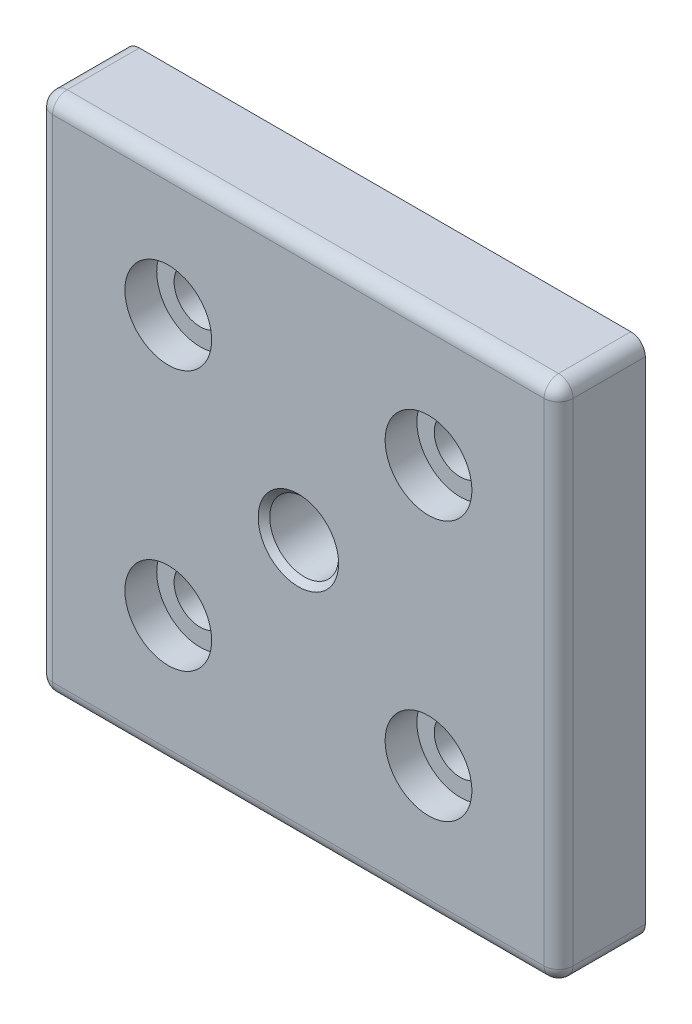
ISO-10303-21;
HEADER;
FILE_DESCRIPTION(('STEP AP214'),'2;1');
FILE_NAME('part.step','',(''),(''),'','','');
FILE_SCHEMA(('AUTOMOTIVE_DESIGN { 1 0 10303 214 1 1 1 1 }'));
ENDSEC;
DATA;
#1=APPLICATION_CONTEXT('core data for automotive mechanical design processes');
#2=APPLICATION_PROTOCOL_DEFINITION('international standard','automotive_design',2000,#1);
#3=PRODUCT_CONTEXT('',#1,'mechanical');
#4=PRODUCT('Part','Part','',(#3));
#5=PRODUCT_RELATED_PRODUCT_CATEGORY('part','',(#4));
#6=PRODUCT_DEFINITION_FORMATION('','',#4);
#7=PRODUCT_DEFINITION_CONTEXT('part definition',#1,'design');
#8=PRODUCT_DEFINITION('design','',#6,#7);
#9=PRODUCT_DEFINITION_SHAPE('','',#8);
#10=(LENGTH_UNIT() NAMED_UNIT(*) SI_UNIT(.MILLI.,.METRE.));
#11=(NAMED_UNIT(*) PLANE_ANGLE_UNIT() SI_UNIT($,.RADIAN.));
#12=(NAMED_UNIT(*) SI_UNIT($,.STERADIAN.) SOLID_ANGLE_UNIT());
#13=UNCERTAINTY_MEASURE_WITH_UNIT(LENGTH_MEASURE(1.E-05),#10,'distance_accuracy_value','');
#14=(GEOMETRIC_REPRESENTATION_CONTEXT(3) GLOBAL_UNCERTAINTY_ASSIGNED_CONTEXT((#13)) GLOBAL_UNIT_ASSIGNED_CONTEXT((#10,
#11,#12)) REPRESENTATION_CONTEXT('',''));
#15=CARTESIAN_POINT('',(0.,0.,0.));
#16=DIRECTION('',(0.,0.,1.));
#17=DIRECTION('',(1.,0.,0.));
#18=AXIS2_PLACEMENT_3D('',#15,#16,#17);
#19=CARTESIAN_POINT('',(0.,0.,15.));
#20=DIRECTION('',(0.,0.,1.));
#21=DIRECTION('',(1.,0.,0.));
#22=AXIS2_PLACEMENT_3D('',#19,#20,#21);
#23=PLANE('',#22);
#24=CARTESIAN_POINT('',(0.,0.,15.0000000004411));
#25=DIRECTION('',(0.,0.,1.));
#26=DIRECTION('',(1.,0.,0.));
#27=AXIS2_PLACEMENT_3D('',#24,#25,#26);
#28=CIRCLE('',#27,6.95312499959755);
#29=CARTESIAN_POINT('',(6.95312499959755,0.,15.0000000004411));
#30=VERTEX_POINT('',#29);
#31=EDGE_CURVE('E119',#30,#30,#28,.F.);
#32=ORIENTED_EDGE('',*,*,#31,.T.);
#33=EDGE_LOOP('',(#32));
#34=FACE_BOUND('',#33,.T.);
#35=CARTESIAN_POINT('',(22.5,-22.5,15.));
#36=DIRECTION('',(0.,0.,-1.));
#37=DIRECTION('',(-1.,0.,0.));
#38=AXIS2_PLACEMENT_3D('',#35,#36,#37);
#39=CIRCLE('',#38,7.5);
#40=CARTESIAN_POINT('',(15.,-22.5,15.));
#41=VERTEX_POINT('',#40);
#42=EDGE_CURVE('E123',#41,#41,#39,.T.);
#43=ORIENTED_EDGE('',*,*,#42,.T.);
#44=EDGE_LOOP('',(#43));
#45=FACE_BOUND('',#44,.T.);
#46=CARTESIAN_POINT('',(-22.5,-22.5,15.));
#47=DIRECTION('',(0.,0.,-1.));
#48=DIRECTION('',(-1.,0.,0.));
#49=AXIS2_PLACEMENT_3D('',#46,#47,#48);
#50=CIRCLE('',#49,7.5);
#51=CARTESIAN_POINT('',(-30.,-22.5,15.));
#52=VERTEX_POINT('',#51);
#53=EDGE_CURVE('E127',#52,#52,#50,.T.);
#54=ORIENTED_EDGE('',*,*,#53,.T.);
#55=EDGE_LOOP('',(#54));
#56=FACE_BOUND('',#55,.T.);
#57=CARTESIAN_POINT('',(-22.5,22.5,15.));
#58=DIRECTION('',(0.,0.,-1.));
#59=DIRECTION('',(-1.,0.,0.));
#60=AXIS2_PLACEMENT_3D('',#57,#58,#59);
#61=CIRCLE('',#60,7.5);
#62=CARTESIAN_POINT('',(-30.,22.5,15.));
#63=VERTEX_POINT('',#62);
#64=EDGE_CURVE('E19',#63,#63,#61,.T.);
#65=ORIENTED_EDGE('',*,*,#64,.T.);
#66=EDGE_LOOP('',(#65));
#67=FACE_BOUND('',#66,.T.);
#68=CARTESIAN_POINT('',(22.5,22.5,15.));
#69=DIRECTION('',(0.,0.,-1.));
#70=DIRECTION('',(-1.,0.,0.));
#71=AXIS2_PLACEMENT_3D('',#68,#69,#70);
#72=CIRCLE('',#71,7.5);
#73=CARTESIAN_POINT('',(15.,22.5,15.));
#74=VERTEX_POINT('',#73);
#75=EDGE_CURVE('E129',#74,#74,#72,.T.);
#76=ORIENTED_EDGE('',*,*,#75,.T.);
#77=EDGE_LOOP('',(#76));
#78=FACE_BOUND('',#77,.T.);
#79=DIRECTION('',(-1.,0.,0.));
#80=VECTOR('',#79,1.);
#81=CARTESIAN_POINT('',(22.5,-42.5,15.));
#82=LINE('',#81,#80);
#83=CARTESIAN_POINT('',(42.5,-42.5,15.));
#84=VERTEX_POINT('',#83);
#85=CARTESIAN_POINT('',(-42.5,-42.5,15.));
#86=VERTEX_POINT('',#85);
#87=EDGE_CURVE('E362',#84,#86,#82,.T.);
#88=ORIENTED_EDGE('',*,*,#87,.F.);
#89=DIRECTION('',(0.,-1.,0.));
#90=VECTOR('',#89,1.);
#91=CARTESIAN_POINT('',(42.5,22.5,15.));
#92=LINE('',#91,#90);
#93=CARTESIAN_POINT('',(42.5,42.5,15.));
#94=VERTEX_POINT('',#93);
#95=EDGE_CURVE('E229',#94,#84,#92,.T.);
#96=ORIENTED_EDGE('',*,*,#95,.F.);
#97=DIRECTION('',(1.,0.,0.));
#98=VECTOR('',#97,1.);
#99=CARTESIAN_POINT('',(-22.5,42.5,15.));
#100=LINE('',#99,#98);
#101=CARTESIAN_POINT('',(-42.5,42.5,15.));
#102=VERTEX_POINT('',#101);
#103=EDGE_CURVE('E126',#102,#94,#100,.T.);
#104=ORIENTED_EDGE('',*,*,#103,.F.);
#105=DIRECTION('',(0.,1.,0.));
#106=VECTOR('',#105,1.);
#107=CARTESIAN_POINT('',(-42.5,-22.5,15.));
#108=LINE('',#107,#106);
#109=EDGE_CURVE('E272',#86,#102,#108,.T.);
#110=ORIENTED_EDGE('',*,*,#109,.F.);
#111=EDGE_LOOP('',(#88,#96,#104,#110));
#112=FACE_BOUND('',#111,.T.);
#113=ADVANCED_FACE('F15',(#34,#45,#56,#67,#78,#112),#23,.T.);
#114=CARTESIAN_POINT('',(-22.5,22.5,15.));
#115=DIRECTION('',(0.,0.,-1.));
#116=DIRECTION('',(-1.,0.,0.));
#117=AXIS2_PLACEMENT_3D('',#114,#115,#116);
#118=CYLINDRICAL_SURFACE('',#117,7.5);
#119=CARTESIAN_POINT('',(-22.5,22.5,9.5));
#120=DIRECTION('',(0.,0.,-1.));
#121=DIRECTION('',(-1.,0.,0.));
#122=AXIS2_PLACEMENT_3D('',#119,#120,#121);
#123=CIRCLE('',#122,7.5);
#124=CARTESIAN_POINT('',(-30.,22.5,9.5));
#125=VERTEX_POINT('',#124);
#126=EDGE_CURVE('E116',#125,#125,#123,.T.);
#127=ORIENTED_EDGE('',*,*,#126,.T.);
#128=EDGE_LOOP('',(#127));
#129=FACE_BOUND('',#128,.T.);
#130=ORIENTED_EDGE('',*,*,#64,.F.);
#131=EDGE_LOOP('',(#130));
#132=FACE_BOUND('',#131,.T.);
#133=ADVANCED_FACE('F137',(#129,#132),#118,.F.);
#134=CARTESIAN_POINT('',(22.5,22.5,15.));
#135=DIRECTION('',(0.,0.,-1.));
#136=DIRECTION('',(-1.,0.,0.));
#137=AXIS2_PLACEMENT_3D('',#134,#135,#136);
#138=CYLINDRICAL_SURFACE('',#137,7.5);
#139=CARTESIAN_POINT('',(22.5,22.5,9.5));
#140=DIRECTION('',(0.,0.,-1.));
#141=DIRECTION('',(-1.,0.,0.));
#142=AXIS2_PLACEMENT_3D('',#139,#140,#141);
#143=CIRCLE('',#142,7.5);
#144=CARTESIAN_POINT('',(15.,22.5,9.5));
#145=VERTEX_POINT('',#144);
#146=EDGE_CURVE('E113',#145,#145,#143,.T.);
#147=ORIENTED_EDGE('',*,*,#146,.T.);
#148=EDGE_LOOP('',(#147));
#149=FACE_BOUND('',#148,.T.);
#150=ORIENTED_EDGE('',*,*,#75,.F.);
#151=EDGE_LOOP('',(#150));
#152=FACE_BOUND('',#151,.T.);
#153=ADVANCED_FACE('F139',(#149,#152),#138,.F.);
#154=CARTESIAN_POINT('',(-22.5,-22.5,15.));
#155=DIRECTION('',(0.,0.,-1.));
#156=DIRECTION('',(-1.,0.,0.));
#157=AXIS2_PLACEMENT_3D('',#154,#155,#156);
#158=CYLINDRICAL_SURFACE('',#157,7.5);
#159=CARTESIAN_POINT('',(-22.5,-22.5,9.5));
#160=DIRECTION('',(0.,0.,-1.));
#161=DIRECTION('',(-1.,0.,0.));
#162=AXIS2_PLACEMENT_3D('',#159,#160,#161);
#163=CIRCLE('',#162,7.5);
#164=CARTESIAN_POINT('',(-30.,-22.5,9.5));
#165=VERTEX_POINT('',#164);
#166=EDGE_CURVE('E110',#165,#165,#163,.T.);
#167=ORIENTED_EDGE('',*,*,#166,.T.);
#168=EDGE_LOOP('',(#167));
#169=FACE_BOUND('',#168,.T.);
#170=ORIENTED_EDGE('',*,*,#53,.F.);
#171=EDGE_LOOP('',(#170));
#172=FACE_BOUND('',#171,.T.);
#173=ADVANCED_FACE('F147',(#169,#172),#158,.F.);
#174=CARTESIAN_POINT('',(22.5,-22.5,15.));
#175=DIRECTION('',(0.,0.,-1.));
#176=DIRECTION('',(-1.,0.,0.));
#177=AXIS2_PLACEMENT_3D('',#174,#175,#176);
#178=CYLINDRICAL_SURFACE('',#177,7.5);
#179=CARTESIAN_POINT('',(22.5,-22.5,9.5));
#180=DIRECTION('',(0.,0.,-1.));
#181=DIRECTION('',(-1.,0.,0.));
#182=AXIS2_PLACEMENT_3D('',#179,#180,#181);
#183=CIRCLE('',#182,7.5);
#184=CARTESIAN_POINT('',(15.,-22.5,9.5));
#185=VERTEX_POINT('',#184);
#186=EDGE_CURVE('E106',#185,#185,#183,.T.);
#187=ORIENTED_EDGE('',*,*,#186,.T.);
#188=EDGE_LOOP('',(#187));
#189=FACE_BOUND('',#188,.T.);
#190=ORIENTED_EDGE('',*,*,#42,.F.);
#191=EDGE_LOOP('',(#190));
#192=FACE_BOUND('',#191,.T.);
#193=ADVANCED_FACE('F287',(#189,#192),#178,.F.);
#194=CARTESIAN_POINT('',(-22.5,42.5,12.5));
#195=DIRECTION('',(1.,0.,0.));
#196=DIRECTION('',(0.,1.,0.));
#197=AXIS2_PLACEMENT_3D('',#194,#195,#196);
#198=CYLINDRICAL_SURFACE('',#197,2.5);
#199=CARTESIAN_POINT('',(-42.5,42.5,12.5));
#200=DIRECTION('',(1.,0.,0.));
#201=DIRECTION('',(0.,1.,0.));
#202=AXIS2_PLACEMENT_3D('',#199,#200,#201);
#203=CIRCLE('',#202,2.5);
#204=CARTESIAN_POINT('',(-42.5,45.,12.5));
#205=VERTEX_POINT('',#204);
#206=EDGE_CURVE('E276',#102,#205,#203,.F.);
#207=ORIENTED_EDGE('',*,*,#206,.F.);
#208=ORIENTED_EDGE('',*,*,#103,.T.);
#209=CARTESIAN_POINT('',(42.5,42.5,12.5));
#210=DIRECTION('',(1.,0.,0.));
#211=DIRECTION('',(0.,1.,0.));
#212=AXIS2_PLACEMENT_3D('',#209,#210,#211);
#213=CIRCLE('',#212,2.5);
#214=CARTESIAN_POINT('',(42.5,45.,12.5));
#215=VERTEX_POINT('',#214);
#216=EDGE_CURVE('E226',#215,#94,#213,.T.);
#217=ORIENTED_EDGE('',*,*,#216,.F.);
#218=DIRECTION('',(1.,0.,0.));
#219=VECTOR('',#218,1.);
#220=CARTESIAN_POINT('',(-45.,45.,12.5));
#221=LINE('',#220,#219);
#222=EDGE_CURVE('E109',#205,#215,#221,.T.);
#223=ORIENTED_EDGE('',*,*,#222,.F.);
#224=EDGE_LOOP('',(#207,#208,#217,#223));
#225=FACE_BOUND('',#224,.T.);
#226=ADVANCED_FACE('F284',(#225),#198,.T.);
#227=CARTESIAN_POINT('',(-42.5,42.5,12.5));
#228=DIRECTION('',(1.,0.,0.));
#229=DIRECTION('',(0.,1.,0.));
#230=AXIS2_PLACEMENT_3D('',#227,#228,#229);
#231=SPHERICAL_SURFACE('',#230,2.5);
#232=ORIENTED_EDGE('',*,*,#206,.T.);
#233=CARTESIAN_POINT('',(-42.5,42.5,12.5));
#234=DIRECTION('',(0.,0.,1.));
#235=DIRECTION('',(1.,0.,0.));
#236=AXIS2_PLACEMENT_3D('',#233,#234,#235);
#237=CIRCLE('',#236,2.5);
#238=CARTESIAN_POINT('',(-45.,42.5,12.5));
#239=VERTEX_POINT('',#238);
#240=EDGE_CURVE('E232',#239,#205,#237,.F.);
#241=ORIENTED_EDGE('',*,*,#240,.F.);
#242=CARTESIAN_POINT('',(-42.5,42.5,12.5));
#243=DIRECTION('',(0.,1.,0.));
#244=DIRECTION('',(-1.,0.,0.));
#245=AXIS2_PLACEMENT_3D('',#242,#243,#244);
#246=CIRCLE('',#245,2.5);
#247=EDGE_CURVE('E273',#102,#239,#246,.F.);
#248=ORIENTED_EDGE('',*,*,#247,.F.);
#249=EDGE_LOOP('',(#232,#241,#248));
#250=FACE_BOUND('',#249,.T.);
#251=ADVANCED_FACE('F281',(#250),#231,.T.);
#252=CARTESIAN_POINT('',(-42.5,-22.5,12.5));
#253=DIRECTION('',(0.,1.,0.));
#254=DIRECTION('',(-1.,0.,0.));
#255=AXIS2_PLACEMENT_3D('',#252,#253,#254);
#256=CYLINDRICAL_SURFACE('',#255,2.5);
#257=CARTESIAN_POINT('',(-42.5,-42.5,12.5));
#258=DIRECTION('',(0.,-1.,0.));
#259=DIRECTION('',(1.,0.,0.));
#260=AXIS2_PLACEMENT_3D('',#257,#258,#259);
#261=CIRCLE('',#260,2.5);
#262=CARTESIAN_POINT('',(-45.,-42.5,12.5));
#263=VERTEX_POINT('',#262);
#264=EDGE_CURVE('E268',#86,#263,#261,.T.);
#265=ORIENTED_EDGE('',*,*,#264,.F.);
#266=ORIENTED_EDGE('',*,*,#109,.T.);
#267=ORIENTED_EDGE('',*,*,#247,.T.);
#268=DIRECTION('',(0.,1.,0.));
#269=VECTOR('',#268,1.);
#270=CARTESIAN_POINT('',(-45.,-45.,12.5));
#271=LINE('',#270,#269);
#272=EDGE_CURVE('E74',#263,#239,#271,.T.);
#273=ORIENTED_EDGE('',*,*,#272,.F.);
#274=EDGE_LOOP('',(#265,#266,#267,#273));
#275=FACE_BOUND('',#274,.T.);
#276=ADVANCED_FACE('F261',(#275),#256,.T.);
#277=CARTESIAN_POINT('',(-42.5,-42.5,12.5));
#278=DIRECTION('',(1.,0.,0.));
#279=DIRECTION('',(0.,1.,0.));
#280=AXIS2_PLACEMENT_3D('',#277,#278,#279);
#281=SPHERICAL_SURFACE('',#280,2.5);
#282=ORIENTED_EDGE('',*,*,#264,.T.);
#283=CARTESIAN_POINT('',(-42.5,-42.5,12.5));
#284=DIRECTION('',(0.,0.,1.));
#285=DIRECTION('',(1.,0.,0.));
#286=AXIS2_PLACEMENT_3D('',#283,#284,#285);
#287=CIRCLE('',#286,2.5);
#288=CARTESIAN_POINT('',(-42.5,-45.,12.5));
#289=VERTEX_POINT('',#288);
#290=EDGE_CURVE('E357',#289,#263,#287,.F.);
#291=ORIENTED_EDGE('',*,*,#290,.F.);
#292=CARTESIAN_POINT('',(-42.5,-42.5,12.5));
#293=DIRECTION('',(-1.,0.,0.));
#294=DIRECTION('',(0.,-1.,0.));
#295=AXIS2_PLACEMENT_3D('',#292,#293,#294);
#296=CIRCLE('',#295,2.5);
#297=EDGE_CURVE('E271',#86,#289,#296,.F.);
#298=ORIENTED_EDGE('',*,*,#297,.F.);
#299=EDGE_LOOP('',(#282,#291,#298));
#300=FACE_BOUND('',#299,.T.);
#301=ADVANCED_FACE('F256',(#300),#281,.T.);
#302=CARTESIAN_POINT('',(22.5,-42.5,12.5));
#303=DIRECTION('',(-1.,0.,0.));
#304=DIRECTION('',(0.,-1.,0.));
#305=AXIS2_PLACEMENT_3D('',#302,#303,#304);
#306=CYLINDRICAL_SURFACE('',#305,2.5);
#307=CARTESIAN_POINT('',(42.5,-42.5,12.5));
#308=DIRECTION('',(1.,0.,0.));
#309=DIRECTION('',(0.,1.,0.));
#310=AXIS2_PLACEMENT_3D('',#307,#308,#309);
#311=CIRCLE('',#310,2.5);
#312=CARTESIAN_POINT('',(42.5,-45.,12.5));
#313=VERTEX_POINT('',#312);
#314=EDGE_CURVE('E241',#84,#313,#311,.T.);
#315=ORIENTED_EDGE('',*,*,#314,.F.);
#316=ORIENTED_EDGE('',*,*,#87,.T.);
#317=ORIENTED_EDGE('',*,*,#297,.T.);
#318=DIRECTION('',(1.,0.,0.));
#319=VECTOR('',#318,1.);
#320=CARTESIAN_POINT('',(45.,-45.,12.5));
#321=LINE('',#320,#319);
#322=EDGE_CURVE('E242',#313,#289,#321,.F.);
#323=ORIENTED_EDGE('',*,*,#322,.F.);
#324=EDGE_LOOP('',(#315,#316,#317,#323));
#325=FACE_BOUND('',#324,.T.);
#326=ADVANCED_FACE('F252',(#325),#306,.T.);
#327=CARTESIAN_POINT('',(42.5,-42.5,12.5));
#328=DIRECTION('',(1.,0.,0.));
#329=DIRECTION('',(0.,1.,0.));
#330=AXIS2_PLACEMENT_3D('',#327,#328,#329);
#331=SPHERICAL_SURFACE('',#330,2.5);
#332=CARTESIAN_POINT('',(42.5,-42.5,12.5));
#333=DIRECTION('',(0.,-1.,0.));
#334=DIRECTION('',(0.,0.,-1.));
#335=AXIS2_PLACEMENT_3D('',#332,#333,#334);
#336=CIRCLE('',#335,2.5);
#337=CARTESIAN_POINT('',(45.,-42.5,12.5));
#338=VERTEX_POINT('',#337);
#339=EDGE_CURVE('E238',#84,#338,#336,.F.);
#340=ORIENTED_EDGE('',*,*,#339,.F.);
#341=ORIENTED_EDGE('',*,*,#314,.T.);
#342=CARTESIAN_POINT('',(42.5,-42.5,12.5));
#343=DIRECTION('',(0.,0.,1.));
#344=DIRECTION('',(1.,0.,0.));
#345=AXIS2_PLACEMENT_3D('',#342,#343,#344);
#346=CIRCLE('',#345,2.5);
#347=EDGE_CURVE('E233',#338,#313,#346,.F.);
#348=ORIENTED_EDGE('',*,*,#347,.F.);
#349=EDGE_LOOP('',(#340,#341,#348));
#350=FACE_BOUND('',#349,.T.);
#351=ADVANCED_FACE('F249',(#350),#331,.T.);
#352=CARTESIAN_POINT('',(42.5,22.5,12.5));
#353=DIRECTION('',(0.,-1.,0.));
#354=DIRECTION('',(0.,0.,-1.));
#355=AXIS2_PLACEMENT_3D('',#352,#353,#354);
#356=CYLINDRICAL_SURFACE('',#355,2.5);
#357=CARTESIAN_POINT('',(42.5,42.5,12.5));
#358=DIRECTION('',(0.,-1.,0.));
#359=DIRECTION('',(1.,0.,0.));
#360=AXIS2_PLACEMENT_3D('',#357,#358,#359);
#361=CIRCLE('',#360,2.5);
#362=CARTESIAN_POINT('',(45.,42.5,12.5));
#363=VERTEX_POINT('',#362);
#364=EDGE_CURVE('E122',#94,#363,#361,.F.);
#365=ORIENTED_EDGE('',*,*,#364,.F.);
#366=ORIENTED_EDGE('',*,*,#95,.T.);
#367=ORIENTED_EDGE('',*,*,#339,.T.);
#368=DIRECTION('',(0.,1.,0.));
#369=VECTOR('',#368,1.);
#370=CARTESIAN_POINT('',(45.,45.,12.5));
#371=LINE('',#370,#369);
#372=EDGE_CURVE('E341',#363,#338,#371,.F.);
#373=ORIENTED_EDGE('',*,*,#372,.F.);
#374=EDGE_LOOP('',(#365,#366,#367,#373));
#375=FACE_BOUND('',#374,.T.);
#376=ADVANCED_FACE('F216',(#375),#356,.T.);
#377=CARTESIAN_POINT('',(42.5,42.5,12.5));
#378=DIRECTION('',(1.,0.,0.));
#379=DIRECTION('',(0.,1.,0.));
#380=AXIS2_PLACEMENT_3D('',#377,#378,#379);
#381=SPHERICAL_SURFACE('',#380,2.5);
#382=ORIENTED_EDGE('',*,*,#216,.T.);
#383=ORIENTED_EDGE('',*,*,#364,.T.);
#384=CARTESIAN_POINT('',(42.5,42.5,12.5));
#385=DIRECTION('',(0.,0.,1.));
#386=DIRECTION('',(1.,0.,0.));
#387=AXIS2_PLACEMENT_3D('',#384,#385,#386);
#388=CIRCLE('',#387,2.5);
#389=EDGE_CURVE('E222',#215,#363,#388,.F.);
#390=ORIENTED_EDGE('',*,*,#389,.F.);
#391=EDGE_LOOP('',(#382,#383,#390));
#392=FACE_BOUND('',#391,.T.);
#393=ADVANCED_FACE('F211',(#392),#381,.T.);
#394=CARTESIAN_POINT('',(0.,0.,15.0000000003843));
#395=DIRECTION('',(0.,0.,1.));
#396=DIRECTION('',(1.,0.,0.));
#397=AXIS2_PLACEMENT_3D('',#394,#395,#396);
#398=CONICAL_SURFACE('',#397,6.95312499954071,0.785398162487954);
#399=ORIENTED_EDGE('',*,*,#31,.F.);
#400=EDGE_LOOP('',(#399));
#401=FACE_BOUND('',#400,.T.);
#402=CARTESIAN_POINT('',(0.,0.,14.));
#403=DIRECTION('',(0.,0.,1.));
#404=DIRECTION('',(1.,0.,0.));
#405=AXIS2_PLACEMENT_3D('',#402,#403,#404);
#406=CIRCLE('',#405,5.953125);
#407=CARTESIAN_POINT('',(5.953125,0.,14.));
#408=VERTEX_POINT('',#407);
#409=EDGE_CURVE('E105',#408,#408,#406,.F.);
#410=ORIENTED_EDGE('',*,*,#409,.T.);
#411=EDGE_LOOP('',(#410));
#412=FACE_BOUND('',#411,.T.);
#413=ADVANCED_FACE('F207',(#401,#412),#398,.F.);
#414=CARTESIAN_POINT('',(-30.15,30.15,9.5));
#415=DIRECTION('',(0.,0.,-1.));
#416=DIRECTION('',(1.,0.,0.));
#417=AXIS2_PLACEMENT_3D('',#414,#415,#416);
#418=PLANE('',#417);
#419=CARTESIAN_POINT('',(-22.5,22.5,9.5));
#420=DIRECTION('',(0.,0.,1.));
#421=DIRECTION('',(1.,0.,0.));
#422=AXIS2_PLACEMENT_3D('',#419,#420,#421);
#423=CIRCLE('',#422,4.5);
#424=CARTESIAN_POINT('',(-18.,22.5,9.5));
#425=VERTEX_POINT('',#424);
#426=EDGE_CURVE('E102',#425,#425,#423,.F.);
#427=ORIENTED_EDGE('',*,*,#426,.T.);
#428=EDGE_LOOP('',(#427));
#429=FACE_BOUND('',#428,.T.);
#430=ORIENTED_EDGE('',*,*,#126,.F.);
#431=EDGE_LOOP('',(#430));
#432=FACE_BOUND('',#431,.T.);
#433=ADVANCED_FACE('F210',(#429,#432),#418,.F.);
#434=CARTESIAN_POINT('',(14.85,30.15,9.5));
#435=DIRECTION('',(0.,0.,-1.));
#436=DIRECTION('',(1.,0.,0.));
#437=AXIS2_PLACEMENT_3D('',#434,#435,#436);
#438=PLANE('',#437);
#439=CARTESIAN_POINT('',(22.5,22.5,9.5));
#440=DIRECTION('',(0.,0.,1.));
#441=DIRECTION('',(1.,0.,0.));
#442=AXIS2_PLACEMENT_3D('',#439,#440,#441);
#443=CIRCLE('',#442,4.5);
#444=CARTESIAN_POINT('',(27.,22.5,9.5));
#445=VERTEX_POINT('',#444);
#446=EDGE_CURVE('E99',#445,#445,#443,.F.);
#447=ORIENTED_EDGE('',*,*,#446,.T.);
#448=EDGE_LOOP('',(#447));
#449=FACE_BOUND('',#448,.T.);
#450=ORIENTED_EDGE('',*,*,#146,.F.);
#451=EDGE_LOOP('',(#450));
#452=FACE_BOUND('',#451,.T.);
#453=ADVANCED_FACE('F400',(#449,#452),#438,.F.);
#454=CARTESIAN_POINT('',(-30.15,-14.85,9.5));
#455=DIRECTION('',(0.,0.,-1.));
#456=DIRECTION('',(1.,0.,0.));
#457=AXIS2_PLACEMENT_3D('',#454,#455,#456);
#458=PLANE('',#457);
#459=CARTESIAN_POINT('',(-22.5,-22.5,9.5));
#460=DIRECTION('',(0.,0.,1.));
#461=DIRECTION('',(1.,0.,0.));
#462=AXIS2_PLACEMENT_3D('',#459,#460,#461);
#463=CIRCLE('',#462,4.5);
#464=CARTESIAN_POINT('',(-18.,-22.5,9.5));
#465=VERTEX_POINT('',#464);
#466=EDGE_CURVE('E96',#465,#465,#463,.F.);
#467=ORIENTED_EDGE('',*,*,#466,.T.);
#468=EDGE_LOOP('',(#467));
#469=FACE_BOUND('',#468,.T.);
#470=ORIENTED_EDGE('',*,*,#166,.F.);
#471=EDGE_LOOP('',(#470));
#472=FACE_BOUND('',#471,.T.);
#473=ADVANCED_FACE('F406',(#469,#472),#458,.F.);
#474=CARTESIAN_POINT('',(14.85,-14.85,9.5));
#475=DIRECTION('',(0.,0.,-1.));
#476=DIRECTION('',(1.,0.,0.));
#477=AXIS2_PLACEMENT_3D('',#474,#475,#476);
#478=PLANE('',#477);
#479=CARTESIAN_POINT('',(22.5,-22.5,9.5));
#480=DIRECTION('',(0.,0.,1.));
#481=DIRECTION('',(1.,0.,0.));
#482=AXIS2_PLACEMENT_3D('',#479,#480,#481);
#483=CIRCLE('',#482,4.5);
#484=CARTESIAN_POINT('',(27.,-22.5,9.5));
#485=VERTEX_POINT('',#484);
#486=EDGE_CURVE('E89',#485,#485,#483,.F.);
#487=ORIENTED_EDGE('',*,*,#486,.T.);
#488=EDGE_LOOP('',(#487));
#489=FACE_BOUND('',#488,.T.);
#490=ORIENTED_EDGE('',*,*,#186,.F.);
#491=EDGE_LOOP('',(#490));
#492=FACE_BOUND('',#491,.T.);
#493=ADVANCED_FACE('F17',(#489,#492),#478,.F.);
#494=CARTESIAN_POINT('',(-45.,45.,0.));
#495=DIRECTION('',(0.,1.,0.));
#496=DIRECTION('',(0.,0.,1.));
#497=AXIS2_PLACEMENT_3D('',#494,#495,#496);
#498=PLANE('',#497);
#499=DIRECTION('',(0.,0.,1.));
#500=VECTOR('',#499,1.);
#501=CARTESIAN_POINT('',(-42.5,45.,0.));
#502=LINE('',#501,#500);
#503=CARTESIAN_POINT('',(-42.5,45.,0.));
#504=VERTEX_POINT('',#503);
#505=EDGE_CURVE('E60',#205,#504,#502,.F.);
#506=ORIENTED_EDGE('',*,*,#505,.F.);
#507=ORIENTED_EDGE('',*,*,#222,.T.);
#508=DIRECTION('',(0.,0.,1.));
#509=VECTOR('',#508,1.);
#510=CARTESIAN_POINT('',(42.5,45.,0.));
#511=LINE('',#510,#509);
#512=CARTESIAN_POINT('',(42.5,45.,0.));
#513=VERTEX_POINT('',#512);
#514=EDGE_CURVE('E339',#513,#215,#511,.T.);
#515=ORIENTED_EDGE('',*,*,#514,.F.);
#516=DIRECTION('',(1.,0.,0.));
#517=VECTOR('',#516,1.);
#518=CARTESIAN_POINT('',(0.,45.,0.));
#519=LINE('',#518,#517);
#520=EDGE_CURVE('E87',#513,#504,#519,.F.);
#521=ORIENTED_EDGE('',*,*,#520,.T.);
#522=EDGE_LOOP('',(#506,#507,#515,#521));
#523=FACE_BOUND('',#522,.T.);
#524=ADVANCED_FACE('F203',(#523),#498,.T.);
#525=CARTESIAN_POINT('',(-42.5,42.5,0.));
#526=DIRECTION('',(0.,0.,1.));
#527=DIRECTION('',(1.,0.,0.));
#528=AXIS2_PLACEMENT_3D('',#525,#526,#527);
#529=CYLINDRICAL_SURFACE('',#528,2.5);
#530=ORIENTED_EDGE('',*,*,#240,.T.);
#531=ORIENTED_EDGE('',*,*,#505,.T.);
#532=CARTESIAN_POINT('',(-42.5,42.5,0.));
#533=DIRECTION('',(0.,0.,1.));
#534=DIRECTION('',(1.,0.,0.));
#535=AXIS2_PLACEMENT_3D('',#532,#533,#534);
#536=CIRCLE('',#535,2.5);
#537=CARTESIAN_POINT('',(-45.,42.5,0.));
#538=VERTEX_POINT('',#537);
#539=EDGE_CURVE('E80',#504,#538,#536,.T.);
#540=ORIENTED_EDGE('',*,*,#539,.T.);
#541=DIRECTION('',(0.,0.,1.));
#542=VECTOR('',#541,1.);
#543=CARTESIAN_POINT('',(-45.,42.5,0.));
#544=LINE('',#543,#542);
#545=EDGE_CURVE('E67',#239,#538,#544,.F.);
#546=ORIENTED_EDGE('',*,*,#545,.F.);
#547=EDGE_LOOP('',(#530,#531,#540,#546));
#548=FACE_BOUND('',#547,.T.);
#549=ADVANCED_FACE('F86',(#548),#529,.T.);
#550=CARTESIAN_POINT('',(-45.,-45.,0.));
#551=DIRECTION('',(-1.,0.,0.));
#552=DIRECTION('',(0.,0.,1.));
#553=AXIS2_PLACEMENT_3D('',#550,#551,#552);
#554=PLANE('',#553);
#555=DIRECTION('',(0.,0.,1.));
#556=VECTOR('',#555,1.);
#557=CARTESIAN_POINT('',(-45.,-42.5,0.));
#558=LINE('',#557,#556);
#559=CARTESIAN_POINT('',(-45.,-42.5,0.));
#560=VERTEX_POINT('',#559);
#561=EDGE_CURVE('E245',#263,#560,#558,.F.);
#562=ORIENTED_EDGE('',*,*,#561,.F.);
#563=ORIENTED_EDGE('',*,*,#272,.T.);
#564=ORIENTED_EDGE('',*,*,#545,.T.);
#565=DIRECTION('',(0.,1.,0.));
#566=VECTOR('',#565,1.);
#567=CARTESIAN_POINT('',(-45.,0.,0.));
#568=LINE('',#567,#566);
#569=EDGE_CURVE('E71',#538,#560,#568,.F.);
#570=ORIENTED_EDGE('',*,*,#569,.T.);
#571=EDGE_LOOP('',(#562,#563,#564,#570));
#572=FACE_BOUND('',#571,.T.);
#573=ADVANCED_FACE('F70',(#572),#554,.T.);
#574=CARTESIAN_POINT('',(-42.5,-42.5,0.));
#575=DIRECTION('',(0.,0.,1.));
#576=DIRECTION('',(1.,0.,0.));
#577=AXIS2_PLACEMENT_3D('',#574,#575,#576);
#578=CYLINDRICAL_SURFACE('',#577,2.5);
#579=ORIENTED_EDGE('',*,*,#290,.T.);
#580=ORIENTED_EDGE('',*,*,#561,.T.);
#581=CARTESIAN_POINT('',(-42.5,-42.5,0.));
#582=DIRECTION('',(0.,0.,1.));
#583=DIRECTION('',(1.,0.,0.));
#584=AXIS2_PLACEMENT_3D('',#581,#582,#583);
#585=CIRCLE('',#584,2.5);
#586=CARTESIAN_POINT('',(-42.5,-45.,0.));
#587=VERTEX_POINT('',#586);
#588=EDGE_CURVE('E84',#560,#587,#585,.T.);
#589=ORIENTED_EDGE('',*,*,#588,.T.);
#590=DIRECTION('',(0.,0.,-1.));
#591=VECTOR('',#590,1.);
#592=CARTESIAN_POINT('',(-42.5,-45.,0.));
#593=LINE('',#592,#591);
#594=EDGE_CURVE('E237',#289,#587,#593,.T.);
#595=ORIENTED_EDGE('',*,*,#594,.F.);
#596=EDGE_LOOP('',(#579,#580,#589,#595));
#597=FACE_BOUND('',#596,.T.);
#598=ADVANCED_FACE('F194',(#597),#578,.T.);
#599=CARTESIAN_POINT('',(45.,-45.,0.));
#600=DIRECTION('',(0.,-1.,0.));
#601=DIRECTION('',(0.,0.,-1.));
#602=AXIS2_PLACEMENT_3D('',#599,#600,#601);
#603=PLANE('',#602);
#604=ORIENTED_EDGE('',*,*,#594,.T.);
#605=DIRECTION('',(1.,0.,0.));
#606=VECTOR('',#605,1.);
#607=CARTESIAN_POINT('',(0.,-45.,0.));
#608=LINE('',#607,#606);
#609=CARTESIAN_POINT('',(42.5,-45.,0.));
#610=VERTEX_POINT('',#609);
#611=EDGE_CURVE('E383',#587,#610,#608,.T.);
#612=ORIENTED_EDGE('',*,*,#611,.T.);
#613=DIRECTION('',(0.,0.,1.));
#614=VECTOR('',#613,1.);
#615=CARTESIAN_POINT('',(42.5,-45.,0.));
#616=LINE('',#615,#614);
#617=EDGE_CURVE('E236',#313,#610,#616,.F.);
#618=ORIENTED_EDGE('',*,*,#617,.F.);
#619=ORIENTED_EDGE('',*,*,#322,.T.);
#620=EDGE_LOOP('',(#604,#612,#618,#619));
#621=FACE_BOUND('',#620,.T.);
#622=ADVANCED_FACE('F190',(#621),#603,.T.);
#623=CARTESIAN_POINT('',(42.5,-42.5,0.));
#624=DIRECTION('',(0.,0.,1.));
#625=DIRECTION('',(1.,0.,0.));
#626=AXIS2_PLACEMENT_3D('',#623,#624,#625);
#627=CYLINDRICAL_SURFACE('',#626,2.5);
#628=ORIENTED_EDGE('',*,*,#347,.T.);
#629=ORIENTED_EDGE('',*,*,#617,.T.);
#630=CARTESIAN_POINT('',(42.5,-42.5,0.));
#631=DIRECTION('',(0.,0.,1.));
#632=DIRECTION('',(1.,0.,0.));
#633=AXIS2_PLACEMENT_3D('',#630,#631,#632);
#634=CIRCLE('',#633,2.5);
#635=CARTESIAN_POINT('',(45.,-42.5,0.));
#636=VERTEX_POINT('',#635);
#637=EDGE_CURVE('E381',#610,#636,#634,.T.);
#638=ORIENTED_EDGE('',*,*,#637,.T.);
#639=DIRECTION('',(0.,0.,-1.));
#640=VECTOR('',#639,1.);
#641=CARTESIAN_POINT('',(45.,-42.5,0.));
#642=LINE('',#641,#640);
#643=EDGE_CURVE('E344',#338,#636,#642,.T.);
#644=ORIENTED_EDGE('',*,*,#643,.F.);
#645=EDGE_LOOP('',(#628,#629,#638,#644));
#646=FACE_BOUND('',#645,.T.);
#647=ADVANCED_FACE('F186',(#646),#627,.T.);
#648=CARTESIAN_POINT('',(45.,45.,0.));
#649=DIRECTION('',(1.,0.,0.));
#650=DIRECTION('',(0.,0.,-1.));
#651=AXIS2_PLACEMENT_3D('',#648,#649,#650);
#652=PLANE('',#651);
#653=ORIENTED_EDGE('',*,*,#643,.T.);
#654=DIRECTION('',(0.,1.,0.));
#655=VECTOR('',#654,1.);
#656=CARTESIAN_POINT('',(45.,0.,0.));
#657=LINE('',#656,#655);
#658=CARTESIAN_POINT('',(45.,42.5,0.));
#659=VERTEX_POINT('',#658);
#660=EDGE_CURVE('E346',#636,#659,#657,.T.);
#661=ORIENTED_EDGE('',*,*,#660,.T.);
#662=DIRECTION('',(0.,0.,1.));
#663=VECTOR('',#662,1.);
#664=CARTESIAN_POINT('',(45.,42.5,0.));
#665=LINE('',#664,#663);
#666=EDGE_CURVE('E34',#363,#659,#665,.F.);
#667=ORIENTED_EDGE('',*,*,#666,.F.);
#668=ORIENTED_EDGE('',*,*,#372,.T.);
#669=EDGE_LOOP('',(#653,#661,#667,#668));
#670=FACE_BOUND('',#669,.T.);
#671=ADVANCED_FACE('F183',(#670),#652,.T.);
#672=CARTESIAN_POINT('',(42.5,42.5,0.));
#673=DIRECTION('',(0.,0.,1.));
#674=DIRECTION('',(1.,0.,0.));
#675=AXIS2_PLACEMENT_3D('',#672,#673,#674);
#676=CYLINDRICAL_SURFACE('',#675,2.5);
#677=ORIENTED_EDGE('',*,*,#389,.T.);
#678=ORIENTED_EDGE('',*,*,#666,.T.);
#679=CARTESIAN_POINT('',(42.5,42.5,0.));
#680=DIRECTION('',(0.,0.,1.));
#681=DIRECTION('',(1.,0.,0.));
#682=AXIS2_PLACEMENT_3D('',#679,#680,#681);
#683=CIRCLE('',#682,2.5);
#684=EDGE_CURVE('E380',#659,#513,#683,.T.);
#685=ORIENTED_EDGE('',*,*,#684,.T.);
#686=ORIENTED_EDGE('',*,*,#514,.T.);
#687=EDGE_LOOP('',(#677,#678,#685,#686));
#688=FACE_BOUND('',#687,.T.);
#689=ADVANCED_FACE('F179',(#688),#676,.T.);
#690=CARTESIAN_POINT('',(0.,0.,0.));
#691=DIRECTION('',(0.,0.,1.));
#692=DIRECTION('',(1.,0.,0.));
#693=AXIS2_PLACEMENT_3D('',#690,#691,#692);
#694=CYLINDRICAL_SURFACE('',#693,5.953125);
#695=ORIENTED_EDGE('',*,*,#409,.F.);
#696=EDGE_LOOP('',(#695));
#697=FACE_BOUND('',#696,.T.);
#698=CARTESIAN_POINT('',(0.,0.,0.));
#699=DIRECTION('',(0.,0.,1.));
#700=DIRECTION('',(1.,0.,0.));
#701=AXIS2_PLACEMENT_3D('',#698,#699,#700);
#702=CIRCLE('',#701,5.953125);
#703=CARTESIAN_POINT('',(5.953125,0.,0.));
#704=VERTEX_POINT('',#703);
#705=EDGE_CURVE('E377',#704,#704,#702,.F.);
#706=ORIENTED_EDGE('',*,*,#705,.T.);
#707=EDGE_LOOP('',(#706));
#708=FACE_BOUND('',#707,.T.);
#709=ADVANCED_FACE('F175',(#697,#708),#694,.F.);
#710=CARTESIAN_POINT('',(-22.5,22.5,0.));
#711=DIRECTION('',(0.,0.,1.));
#712=DIRECTION('',(1.,0.,0.));
#713=AXIS2_PLACEMENT_3D('',#710,#711,#712);
#714=CYLINDRICAL_SURFACE('',#713,4.5);
#715=CARTESIAN_POINT('',(-22.5,22.5,0.));
#716=DIRECTION('',(0.,0.,1.));
#717=DIRECTION('',(1.,0.,0.));
#718=AXIS2_PLACEMENT_3D('',#715,#716,#717);
#719=CIRCLE('',#718,4.5);
#720=CARTESIAN_POINT('',(-18.,22.5,0.));
#721=VERTEX_POINT('',#720);
#722=EDGE_CURVE('E374',#721,#721,#719,.F.);
#723=ORIENTED_EDGE('',*,*,#722,.T.);
#724=EDGE_LOOP('',(#723));
#725=FACE_BOUND('',#724,.T.);
#726=ORIENTED_EDGE('',*,*,#426,.F.);
#727=EDGE_LOOP('',(#726));
#728=FACE_BOUND('',#727,.T.);
#729=ADVANCED_FACE('F171',(#725,#728),#714,.F.);
#730=CARTESIAN_POINT('',(22.5,22.5,0.));
#731=DIRECTION('',(0.,0.,1.));
#732=DIRECTION('',(1.,0.,0.));
#733=AXIS2_PLACEMENT_3D('',#730,#731,#732);
#734=CYLINDRICAL_SURFACE('',#733,4.5);
#735=CARTESIAN_POINT('',(22.5,22.5,0.));
#736=DIRECTION('',(0.,0.,1.));
#737=DIRECTION('',(1.,0.,0.));
#738=AXIS2_PLACEMENT_3D('',#735,#736,#737);
#739=CIRCLE('',#738,4.5);
#740=CARTESIAN_POINT('',(27.,22.5,0.));
#741=VERTEX_POINT('',#740);
#742=EDGE_CURVE('E371',#741,#741,#739,.F.);
#743=ORIENTED_EDGE('',*,*,#742,.T.);
#744=EDGE_LOOP('',(#743));
#745=FACE_BOUND('',#744,.T.);
#746=ORIENTED_EDGE('',*,*,#446,.F.);
#747=EDGE_LOOP('',(#746));
#748=FACE_BOUND('',#747,.T.);
#749=ADVANCED_FACE('F167',(#745,#748),#734,.F.);
#750=CARTESIAN_POINT('',(-22.5,-22.5,0.));
#751=DIRECTION('',(0.,0.,1.));
#752=DIRECTION('',(1.,0.,0.));
#753=AXIS2_PLACEMENT_3D('',#750,#751,#752);
#754=CYLINDRICAL_SURFACE('',#753,4.5);
#755=CARTESIAN_POINT('',(-22.5,-22.5,0.));
#756=DIRECTION('',(0.,0.,1.));
#757=DIRECTION('',(1.,0.,0.));
#758=AXIS2_PLACEMENT_3D('',#755,#756,#757);
#759=CIRCLE('',#758,4.5);
#760=CARTESIAN_POINT('',(-18.,-22.5,0.));
#761=VERTEX_POINT('',#760);
#762=EDGE_CURVE('E25',#761,#761,#759,.F.);
#763=ORIENTED_EDGE('',*,*,#762,.T.);
#764=EDGE_LOOP('',(#763));
#765=FACE_BOUND('',#764,.T.);
#766=ORIENTED_EDGE('',*,*,#466,.F.);
#767=EDGE_LOOP('',(#766));
#768=FACE_BOUND('',#767,.T.);
#769=ADVANCED_FACE('F159',(#765,#768),#754,.F.);
#770=CARTESIAN_POINT('',(22.5,-22.5,0.));
#771=DIRECTION('',(0.,0.,1.));
#772=DIRECTION('',(1.,0.,0.));
#773=AXIS2_PLACEMENT_3D('',#770,#771,#772);
#774=CYLINDRICAL_SURFACE('',#773,4.5);
#775=CARTESIAN_POINT('',(22.5,-22.5,0.));
#776=DIRECTION('',(0.,0.,1.));
#777=DIRECTION('',(1.,0.,0.));
#778=AXIS2_PLACEMENT_3D('',#775,#776,#777);
#779=CIRCLE('',#778,4.5);
#780=CARTESIAN_POINT('',(27.,-22.5,0.));
#781=VERTEX_POINT('',#780);
#782=EDGE_CURVE('E10',#781,#781,#779,.F.);
#783=ORIENTED_EDGE('',*,*,#782,.T.);
#784=EDGE_LOOP('',(#783));
#785=FACE_BOUND('',#784,.T.);
#786=ORIENTED_EDGE('',*,*,#486,.F.);
#787=EDGE_LOOP('',(#786));
#788=FACE_BOUND('',#787,.T.);
#789=ADVANCED_FACE('F153',(#785,#788),#774,.F.);
#790=CARTESIAN_POINT('',(0.,0.,0.));
#791=DIRECTION('',(0.,0.,1.));
#792=DIRECTION('',(1.,0.,0.));
#793=AXIS2_PLACEMENT_3D('',#790,#791,#792);
#794=PLANE('',#793);
#795=ORIENTED_EDGE('',*,*,#782,.F.);
#796=EDGE_LOOP('',(#795));
#797=FACE_BOUND('',#796,.T.);
#798=ORIENTED_EDGE('',*,*,#762,.F.);
#799=EDGE_LOOP('',(#798));
#800=FACE_BOUND('',#799,.T.);
#801=ORIENTED_EDGE('',*,*,#742,.F.);
#802=EDGE_LOOP('',(#801));
#803=FACE_BOUND('',#802,.T.);
#804=ORIENTED_EDGE('',*,*,#722,.F.);
#805=EDGE_LOOP('',(#804));
#806=FACE_BOUND('',#805,.T.);
#807=ORIENTED_EDGE('',*,*,#705,.F.);
#808=EDGE_LOOP('',(#807));
#809=FACE_BOUND('',#808,.T.);
#810=ORIENTED_EDGE('',*,*,#660,.F.);
#811=ORIENTED_EDGE('',*,*,#637,.F.);
#812=ORIENTED_EDGE('',*,*,#611,.F.);
#813=ORIENTED_EDGE('',*,*,#588,.F.);
#814=ORIENTED_EDGE('',*,*,#569,.F.);
#815=ORIENTED_EDGE('',*,*,#539,.F.);
#816=ORIENTED_EDGE('',*,*,#520,.F.);
#817=ORIENTED_EDGE('',*,*,#684,.F.);
#818=EDGE_LOOP('',(#810,#811,#812,#813,#814,#815,#816,#817));
#819=FACE_BOUND('',#818,.T.);
#820=ADVANCED_FACE('F79',(#797,#800,#803,#806,#809,#819),#794,.F.);
#821=CLOSED_SHELL('',(#113,#133,#153,#173,#193,#226,#251,#276,#301,#326,#351,#376,#393,#413,
#433,#453,#473,#493,#524,#549,#573,#598,#622,#647,#671,#689,#709,#729,#749,#769,#789,#820));
#822=MANIFOLD_SOLID_BREP('B1',#821);
#823=ADVANCED_BREP_SHAPE_REPRESENTATION('',(#18,#822),#14);
#824=SHAPE_DEFINITION_REPRESENTATION(#9,#823);
ENDSEC;
END-ISO-10303-21;
